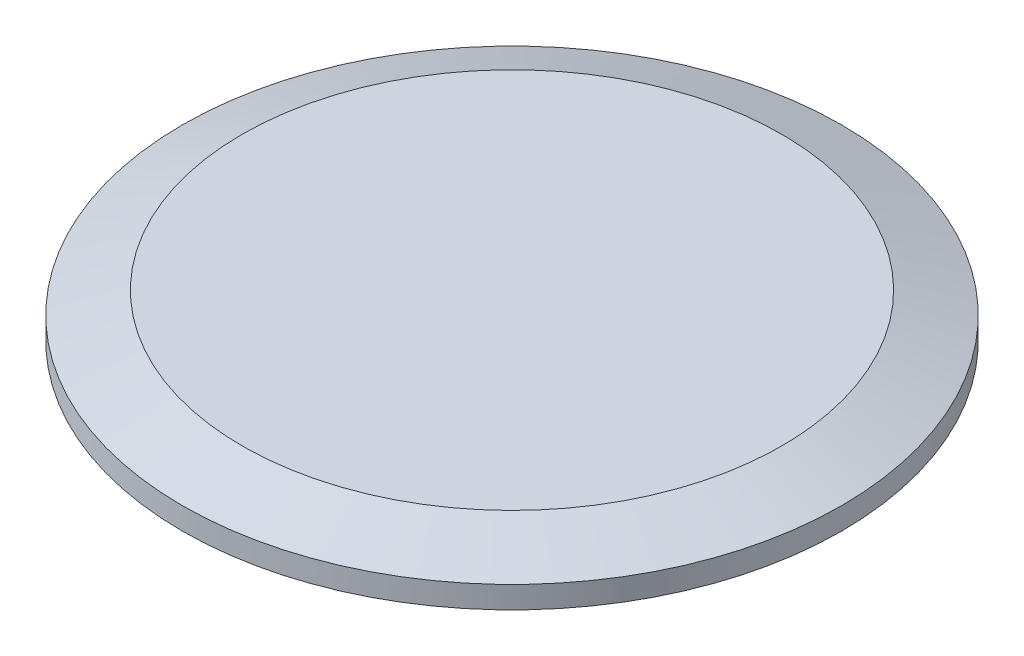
from build123d import *


with BuildPart() as part:
    # Sketch1 → Revolve1 (revolve)
    with BuildSketch(Plane.XY):
        with BuildLine():
            Line((0, 0), (-76.363191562, 0))
            ThreePointArc((-76.363191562, 0), (-76.795388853, 0.129217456), (-77.085733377, 0.474458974))
            ThreePointArc((-77.085733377, 0.474458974), (-78.1812, 1.1938), (-79.276666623, 0.474458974))
            ThreePointArc((-79.276666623, 0.474458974), (-79.567011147, 0.129217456), (-79.999208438, 0))
            Line((-79.999208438, 0), (-83.439, 0))
            Line((-83.439, 0), (-83.439, 5.588))
            Line((-83.439, 5.588), (-68.295453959, 11.0998))
            Line((-68.295453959, 11.0998), (0, 11.0998))
            Line((0, 11.0998), (0, 0))
        make_face()
    revolve(axis=Axis((0, 11.0998, 0), (0, -1, 0)))


solid = part.part
